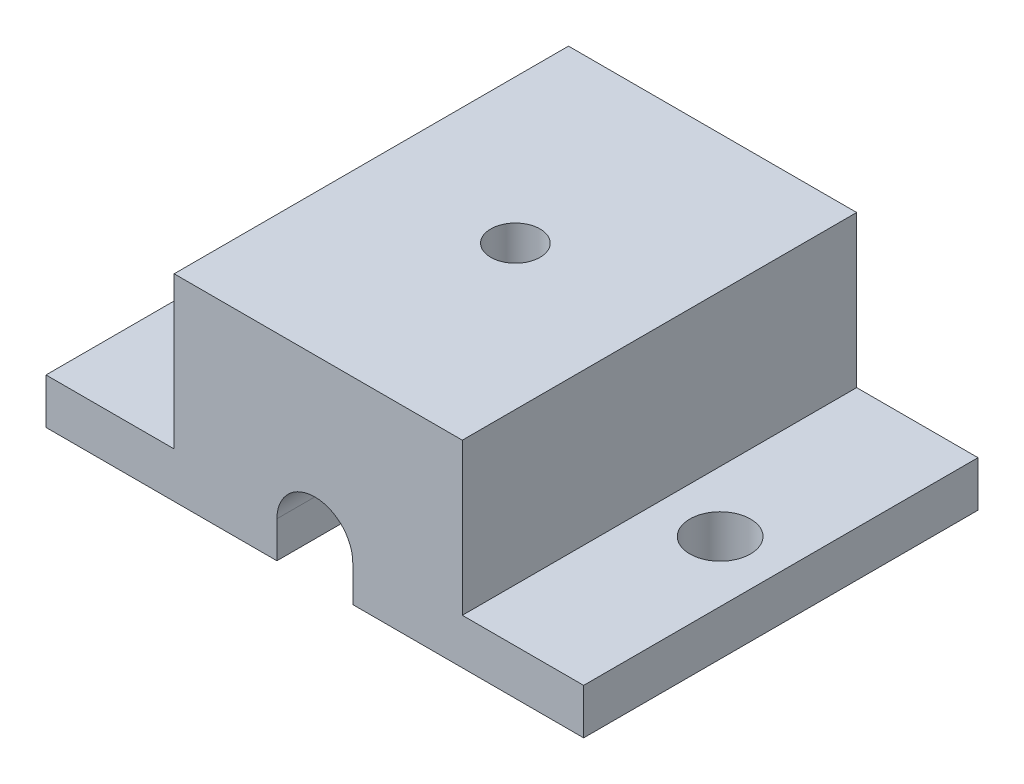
ISO-10303-21;
HEADER;
FILE_DESCRIPTION(('STEP AP214'),'2;1');
FILE_NAME('part.step','',(''),(''),'','','');
FILE_SCHEMA(('AUTOMOTIVE_DESIGN { 1 0 10303 214 1 1 1 1 }'));
ENDSEC;
DATA;
#1=APPLICATION_CONTEXT('core data for automotive mechanical design processes');
#2=APPLICATION_PROTOCOL_DEFINITION('international standard','automotive_design',2000,#1);
#3=PRODUCT_CONTEXT('',#1,'mechanical');
#4=PRODUCT('Part','Part','',(#3));
#5=PRODUCT_RELATED_PRODUCT_CATEGORY('part','',(#4));
#6=PRODUCT_DEFINITION_FORMATION('','',#4);
#7=PRODUCT_DEFINITION_CONTEXT('part definition',#1,'design');
#8=PRODUCT_DEFINITION('design','',#6,#7);
#9=PRODUCT_DEFINITION_SHAPE('','',#8);
#10=(LENGTH_UNIT() NAMED_UNIT(*) SI_UNIT(.MILLI.,.METRE.));
#11=(NAMED_UNIT(*) PLANE_ANGLE_UNIT() SI_UNIT($,.RADIAN.));
#12=(NAMED_UNIT(*) SI_UNIT($,.STERADIAN.) SOLID_ANGLE_UNIT());
#13=UNCERTAINTY_MEASURE_WITH_UNIT(LENGTH_MEASURE(1.E-05),#10,'distance_accuracy_value','');
#14=(GEOMETRIC_REPRESENTATION_CONTEXT(3) GLOBAL_UNCERTAINTY_ASSIGNED_CONTEXT((#13)) GLOBAL_UNIT_ASSIGNED_CONTEXT((#10,
#11,#12)) REPRESENTATION_CONTEXT('',''));
#15=CARTESIAN_POINT('',(0.,0.,0.));
#16=DIRECTION('',(0.,0.,1.));
#17=DIRECTION('',(1.,0.,0.));
#18=AXIS2_PLACEMENT_3D('',#15,#16,#17);
#19=CARTESIAN_POINT('',(35.4483122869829,0.,26.));
#20=DIRECTION('',(0.,1.,0.));
#21=DIRECTION('',(0.,0.,1.));
#22=AXIS2_PLACEMENT_3D('',#19,#20,#21);
#23=PLANE('',#22);
#24=CARTESIAN_POINT('',(4.,0.,13.));
#25=DIRECTION('',(0.,1.,0.));
#26=DIRECTION('',(0.,0.,1.));
#27=AXIS2_PLACEMENT_3D('',#24,#25,#26);
#28=CIRCLE('',#27,2.);
#29=CARTESIAN_POINT('',(4.,0.,15.));
#30=VERTEX_POINT('',#29);
#31=EDGE_CURVE('E208',#30,#30,#28,.T.);
#32=ORIENTED_EDGE('',*,*,#31,.T.);
#33=EDGE_LOOP('',(#32));
#34=FACE_BOUND('',#33,.T.);
#35=DIRECTION('',(1.,0.,0.));
#36=VECTOR('',#35,1.);
#37=CARTESIAN_POINT('',(35.4483122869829,0.,0.));
#38=LINE('',#37,#36);
#39=CARTESIAN_POINT('',(0.,0.,0.));
#40=VERTEX_POINT('',#39);
#41=CARTESIAN_POINT('',(15.225,0.,0.));
#42=VERTEX_POINT('',#41);
#43=EDGE_CURVE('E151',#40,#42,#38,.T.);
#44=ORIENTED_EDGE('',*,*,#43,.T.);
#45=DIRECTION('',(0.,0.,-1.));
#46=VECTOR('',#45,1.);
#47=CARTESIAN_POINT('',(15.225,0.,26.));
#48=LINE('',#47,#46);
#49=CARTESIAN_POINT('',(15.225,0.,26.));
#50=VERTEX_POINT('',#49);
#51=EDGE_CURVE('E224',#50,#42,#48,.T.);
#52=ORIENTED_EDGE('',*,*,#51,.F.);
#53=DIRECTION('',(1.,0.,0.));
#54=VECTOR('',#53,1.);
#55=CARTESIAN_POINT('',(35.4483122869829,0.,26.));
#56=LINE('',#55,#54);
#57=CARTESIAN_POINT('',(0.,0.,26.));
#58=VERTEX_POINT('',#57);
#59=EDGE_CURVE('E203',#58,#50,#56,.T.);
#60=ORIENTED_EDGE('',*,*,#59,.F.);
#61=DIRECTION('',(0.,0.,-1.));
#62=VECTOR('',#61,1.);
#63=CARTESIAN_POINT('',(0.,0.,26.));
#64=LINE('',#63,#62);
#65=EDGE_CURVE('E147',#58,#40,#64,.T.);
#66=ORIENTED_EDGE('',*,*,#65,.T.);
#67=EDGE_LOOP('',(#44,#52,#60,#66));
#68=FACE_BOUND('',#67,.T.);
#69=ADVANCED_FACE('F34',(#34,#68),#23,.F.);
#70=CARTESIAN_POINT('',(31.4483122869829,0.,13.));
#71=DIRECTION('',(0.,1.,0.));
#72=DIRECTION('',(0.,0.,1.));
#73=AXIS2_PLACEMENT_3D('',#70,#71,#72);
#74=CIRCLE('',#73,2.00000000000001);
#75=CARTESIAN_POINT('',(31.4483122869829,0.,15.));
#76=VERTEX_POINT('',#75);
#77=EDGE_CURVE('E205',#76,#76,#74,.T.);
#78=ORIENTED_EDGE('',*,*,#77,.T.);
#79=EDGE_LOOP('',(#78));
#80=FACE_BOUND('',#79,.T.);
#81=CARTESIAN_POINT('',(20.225,0.,26.));
#82=VERTEX_POINT('',#81);
#83=CARTESIAN_POINT('',(35.4483122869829,0.,26.));
#84=VERTEX_POINT('',#83);
#85=EDGE_CURVE('E105',#82,#84,#56,.T.);
#86=ORIENTED_EDGE('',*,*,#85,.F.);
#87=DIRECTION('',(0.,0.,-1.));
#88=VECTOR('',#87,1.);
#89=CARTESIAN_POINT('',(20.225,0.,26.));
#90=LINE('',#89,#88);
#91=CARTESIAN_POINT('',(20.225,0.,0.));
#92=VERTEX_POINT('',#91);
#93=EDGE_CURVE('E220',#82,#92,#90,.T.);
#94=ORIENTED_EDGE('',*,*,#93,.T.);
#95=CARTESIAN_POINT('',(35.4483122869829,0.,0.));
#96=VERTEX_POINT('',#95);
#97=EDGE_CURVE('E155',#92,#96,#38,.T.);
#98=ORIENTED_EDGE('',*,*,#97,.T.);
#99=DIRECTION('',(0.,0.,-1.));
#100=VECTOR('',#99,1.);
#101=CARTESIAN_POINT('',(35.4483122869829,0.,26.));
#102=LINE('',#101,#100);
#103=EDGE_CURVE('E11',#84,#96,#102,.T.);
#104=ORIENTED_EDGE('',*,*,#103,.F.);
#105=EDGE_LOOP('',(#86,#94,#98,#104));
#106=FACE_BOUND('',#105,.T.);
#107=ADVANCED_FACE('F36',(#80,#106),#23,.F.);
#108=CARTESIAN_POINT('',(35.4483122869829,0.,26.));
#109=DIRECTION('',(-1.,0.,0.));
#110=DIRECTION('',(0.,-1.,0.));
#111=AXIS2_PLACEMENT_3D('',#108,#109,#110);
#112=PLANE('',#111);
#113=DIRECTION('',(0.,1.,0.));
#114=VECTOR('',#113,1.);
#115=CARTESIAN_POINT('',(35.4483122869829,0.,0.));
#116=LINE('',#115,#114);
#117=CARTESIAN_POINT('',(35.4483122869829,3.,0.));
#118=VERTEX_POINT('',#117);
#119=EDGE_CURVE('E154',#96,#118,#116,.T.);
#120=ORIENTED_EDGE('',*,*,#119,.T.);
#121=DIRECTION('',(0.,0.,-1.));
#122=VECTOR('',#121,1.);
#123=CARTESIAN_POINT('',(35.4483122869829,3.,26.));
#124=LINE('',#123,#122);
#125=CARTESIAN_POINT('',(35.4483122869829,3.,26.));
#126=VERTEX_POINT('',#125);
#127=EDGE_CURVE('E48',#126,#118,#124,.T.);
#128=ORIENTED_EDGE('',*,*,#127,.F.);
#129=DIRECTION('',(0.,1.,0.));
#130=VECTOR('',#129,1.);
#131=CARTESIAN_POINT('',(35.4483122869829,0.,26.));
#132=LINE('',#131,#130);
#133=EDGE_CURVE('E201',#84,#126,#132,.T.);
#134=ORIENTED_EDGE('',*,*,#133,.F.);
#135=ORIENTED_EDGE('',*,*,#103,.T.);
#136=EDGE_LOOP('',(#120,#128,#134,#135));
#137=FACE_BOUND('',#136,.T.);
#138=ADVANCED_FACE('F266',(#137),#112,.F.);
#139=CARTESIAN_POINT('',(35.4483122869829,3.,26.));
#140=DIRECTION('',(0.,-1.,0.));
#141=DIRECTION('',(1.,0.,0.));
#142=AXIS2_PLACEMENT_3D('',#139,#140,#141);
#143=PLANE('',#142);
#144=CARTESIAN_POINT('',(31.4483122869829,3.,13.));
#145=DIRECTION('',(0.,1.,0.));
#146=DIRECTION('',(0.,0.,1.));
#147=AXIS2_PLACEMENT_3D('',#144,#145,#146);
#148=CIRCLE('',#147,2.00000000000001);
#149=CARTESIAN_POINT('',(31.4483122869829,3.,15.));
#150=VERTEX_POINT('',#149);
#151=EDGE_CURVE('E212',#150,#150,#148,.T.);
#152=ORIENTED_EDGE('',*,*,#151,.F.);
#153=EDGE_LOOP('',(#152));
#154=FACE_BOUND('',#153,.T.);
#155=DIRECTION('',(-1.,0.,0.));
#156=VECTOR('',#155,1.);
#157=CARTESIAN_POINT('',(35.4483122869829,3.,0.));
#158=LINE('',#157,#156);
#159=CARTESIAN_POINT('',(27.4483122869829,3.,0.));
#160=VERTEX_POINT('',#159);
#161=EDGE_CURVE('E157',#118,#160,#158,.T.);
#162=ORIENTED_EDGE('',*,*,#161,.T.);
#163=DIRECTION('',(0.,0.,-1.));
#164=VECTOR('',#163,1.);
#165=CARTESIAN_POINT('',(27.4483122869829,3.,26.));
#166=LINE('',#165,#164);
#167=CARTESIAN_POINT('',(27.4483122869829,3.,26.));
#168=VERTEX_POINT('',#167);
#169=EDGE_CURVE('E173',#168,#160,#166,.T.);
#170=ORIENTED_EDGE('',*,*,#169,.F.);
#171=DIRECTION('',(-1.,0.,0.));
#172=VECTOR('',#171,1.);
#173=CARTESIAN_POINT('',(35.4483122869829,3.,26.));
#174=LINE('',#173,#172);
#175=EDGE_CURVE('E183',#126,#168,#174,.T.);
#176=ORIENTED_EDGE('',*,*,#175,.F.);
#177=ORIENTED_EDGE('',*,*,#127,.T.);
#178=EDGE_LOOP('',(#162,#170,#176,#177));
#179=FACE_BOUND('',#178,.T.);
#180=ADVANCED_FACE('F181',(#154,#179),#143,.F.);
#181=CARTESIAN_POINT('',(27.4483122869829,3.,26.));
#182=DIRECTION('',(-1.,0.,0.));
#183=DIRECTION('',(0.,0.,1.));
#184=AXIS2_PLACEMENT_3D('',#181,#182,#183);
#185=PLANE('',#184);
#186=DIRECTION('',(0.,1.,0.));
#187=VECTOR('',#186,1.);
#188=CARTESIAN_POINT('',(27.4483122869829,3.,0.));
#189=LINE('',#188,#187);
#190=CARTESIAN_POINT('',(27.4483122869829,13.,0.));
#191=VERTEX_POINT('',#190);
#192=EDGE_CURVE('E159',#160,#191,#189,.T.);
#193=ORIENTED_EDGE('',*,*,#192,.T.);
#194=DIRECTION('',(0.,0.,-1.));
#195=VECTOR('',#194,1.);
#196=CARTESIAN_POINT('',(27.4483122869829,13.,26.));
#197=LINE('',#196,#195);
#198=CARTESIAN_POINT('',(27.4483122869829,13.,26.));
#199=VERTEX_POINT('',#198);
#200=EDGE_CURVE('E170',#199,#191,#197,.T.);
#201=ORIENTED_EDGE('',*,*,#200,.F.);
#202=DIRECTION('',(0.,1.,0.));
#203=VECTOR('',#202,1.);
#204=CARTESIAN_POINT('',(27.4483122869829,3.,26.));
#205=LINE('',#204,#203);
#206=EDGE_CURVE('E197',#168,#199,#205,.T.);
#207=ORIENTED_EDGE('',*,*,#206,.F.);
#208=ORIENTED_EDGE('',*,*,#169,.T.);
#209=EDGE_LOOP('',(#193,#201,#207,#208));
#210=FACE_BOUND('',#209,.T.);
#211=ADVANCED_FACE('F193',(#210),#185,.F.);
#212=CARTESIAN_POINT('',(27.4483122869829,13.,26.));
#213=DIRECTION('',(0.,-1.,0.));
#214=DIRECTION('',(0.,0.,-1.));
#215=AXIS2_PLACEMENT_3D('',#212,#213,#214);
#216=PLANE('',#215);
#217=CARTESIAN_POINT('',(17.9483122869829,13.,13.));
#218=DIRECTION('',(0.,1.,0.));
#219=DIRECTION('',(0.,0.,1.));
#220=AXIS2_PLACEMENT_3D('',#217,#218,#219);
#221=CIRCLE('',#220,1.625);
#222=CARTESIAN_POINT('',(17.9483122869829,13.,14.625));
#223=VERTEX_POINT('',#222);
#224=EDGE_CURVE('E241',#223,#223,#221,.T.);
#225=ORIENTED_EDGE('',*,*,#224,.F.);
#226=EDGE_LOOP('',(#225));
#227=FACE_BOUND('',#226,.T.);
#228=DIRECTION('',(-1.,0.,0.));
#229=VECTOR('',#228,1.);
#230=CARTESIAN_POINT('',(27.4483122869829,13.,0.));
#231=LINE('',#230,#229);
#232=CARTESIAN_POINT('',(8.44831228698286,13.,0.));
#233=VERTEX_POINT('',#232);
#234=EDGE_CURVE('E161',#191,#233,#231,.T.);
#235=ORIENTED_EDGE('',*,*,#234,.T.);
#236=DIRECTION('',(0.,0.,-1.));
#237=VECTOR('',#236,1.);
#238=CARTESIAN_POINT('',(8.44831228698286,13.,26.));
#239=LINE('',#238,#237);
#240=CARTESIAN_POINT('',(8.44831228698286,13.,26.));
#241=VERTEX_POINT('',#240);
#242=EDGE_CURVE('E142',#241,#233,#239,.T.);
#243=ORIENTED_EDGE('',*,*,#242,.F.);
#244=DIRECTION('',(-1.,0.,0.));
#245=VECTOR('',#244,1.);
#246=CARTESIAN_POINT('',(27.4483122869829,13.,26.));
#247=LINE('',#246,#245);
#248=EDGE_CURVE('E130',#199,#241,#247,.T.);
#249=ORIENTED_EDGE('',*,*,#248,.F.);
#250=ORIENTED_EDGE('',*,*,#200,.T.);
#251=EDGE_LOOP('',(#235,#243,#249,#250));
#252=FACE_BOUND('',#251,.T.);
#253=ADVANCED_FACE('F196',(#227,#252),#216,.F.);
#254=CARTESIAN_POINT('',(8.44831228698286,13.,26.));
#255=DIRECTION('',(1.,0.,0.));
#256=DIRECTION('',(0.,1.,0.));
#257=AXIS2_PLACEMENT_3D('',#254,#255,#256);
#258=PLANE('',#257);
#259=DIRECTION('',(0.,-1.,0.));
#260=VECTOR('',#259,1.);
#261=CARTESIAN_POINT('',(8.44831228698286,13.,0.));
#262=LINE('',#261,#260);
#263=CARTESIAN_POINT('',(8.44831228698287,3.,0.));
#264=VERTEX_POINT('',#263);
#265=EDGE_CURVE('E139',#233,#264,#262,.T.);
#266=ORIENTED_EDGE('',*,*,#265,.T.);
#267=DIRECTION('',(0.,0.,-1.));
#268=VECTOR('',#267,1.);
#269=CARTESIAN_POINT('',(8.44831228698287,3.,26.));
#270=LINE('',#269,#268);
#271=CARTESIAN_POINT('',(8.44831228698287,3.,26.));
#272=VERTEX_POINT('',#271);
#273=EDGE_CURVE('E136',#272,#264,#270,.T.);
#274=ORIENTED_EDGE('',*,*,#273,.F.);
#275=DIRECTION('',(0.,-1.,0.));
#276=VECTOR('',#275,1.);
#277=CARTESIAN_POINT('',(8.44831228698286,13.,26.));
#278=LINE('',#277,#276);
#279=EDGE_CURVE('E122',#241,#272,#278,.T.);
#280=ORIENTED_EDGE('',*,*,#279,.F.);
#281=ORIENTED_EDGE('',*,*,#242,.T.);
#282=EDGE_LOOP('',(#266,#274,#280,#281));
#283=FACE_BOUND('',#282,.T.);
#284=ADVANCED_FACE('F137',(#283),#258,.F.);
#285=CARTESIAN_POINT('',(8.44831228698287,3.,26.));
#286=DIRECTION('',(0.,-1.,0.));
#287=DIRECTION('',(1.,0.,0.));
#288=AXIS2_PLACEMENT_3D('',#285,#286,#287);
#289=PLANE('',#288);
#290=CARTESIAN_POINT('',(4.,3.,13.));
#291=DIRECTION('',(0.,1.,0.));
#292=DIRECTION('',(0.,0.,1.));
#293=AXIS2_PLACEMENT_3D('',#290,#291,#292);
#294=CIRCLE('',#293,2.);
#295=CARTESIAN_POINT('',(4.,3.,15.));
#296=VERTEX_POINT('',#295);
#297=EDGE_CURVE('E211',#296,#296,#294,.T.);
#298=ORIENTED_EDGE('',*,*,#297,.F.);
#299=EDGE_LOOP('',(#298));
#300=FACE_BOUND('',#299,.T.);
#301=DIRECTION('',(-1.,0.,0.));
#302=VECTOR('',#301,1.);
#303=CARTESIAN_POINT('',(8.44831228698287,3.,0.));
#304=LINE('',#303,#302);
#305=CARTESIAN_POINT('',(0.,3.,0.));
#306=VERTEX_POINT('',#305);
#307=EDGE_CURVE('E164',#264,#306,#304,.T.);
#308=ORIENTED_EDGE('',*,*,#307,.T.);
#309=DIRECTION('',(0.,0.,-1.));
#310=VECTOR('',#309,1.);
#311=CARTESIAN_POINT('',(0.,3.,26.));
#312=LINE('',#311,#310);
#313=CARTESIAN_POINT('',(0.,3.,26.));
#314=VERTEX_POINT('',#313);
#315=EDGE_CURVE('E143',#314,#306,#312,.T.);
#316=ORIENTED_EDGE('',*,*,#315,.F.);
#317=DIRECTION('',(-1.,0.,0.));
#318=VECTOR('',#317,1.);
#319=CARTESIAN_POINT('',(8.44831228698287,3.,26.));
#320=LINE('',#319,#318);
#321=EDGE_CURVE('E127',#272,#314,#320,.T.);
#322=ORIENTED_EDGE('',*,*,#321,.F.);
#323=ORIENTED_EDGE('',*,*,#273,.T.);
#324=EDGE_LOOP('',(#308,#316,#322,#323));
#325=FACE_BOUND('',#324,.T.);
#326=ADVANCED_FACE('F145',(#300,#325),#289,.F.);
#327=CARTESIAN_POINT('',(0.,3.,26.));
#328=DIRECTION('',(1.,0.,0.));
#329=DIRECTION('',(0.,1.,0.));
#330=AXIS2_PLACEMENT_3D('',#327,#328,#329);
#331=PLANE('',#330);
#332=DIRECTION('',(0.,-1.,0.));
#333=VECTOR('',#332,1.);
#334=CARTESIAN_POINT('',(0.,3.,0.));
#335=LINE('',#334,#333);
#336=EDGE_CURVE('E97',#306,#40,#335,.T.);
#337=ORIENTED_EDGE('',*,*,#336,.T.);
#338=ORIENTED_EDGE('',*,*,#65,.F.);
#339=DIRECTION('',(0.,-1.,0.));
#340=VECTOR('',#339,1.);
#341=CARTESIAN_POINT('',(0.,3.,26.));
#342=LINE('',#341,#340);
#343=EDGE_CURVE('E64',#314,#58,#342,.T.);
#344=ORIENTED_EDGE('',*,*,#343,.F.);
#345=ORIENTED_EDGE('',*,*,#315,.T.);
#346=EDGE_LOOP('',(#337,#338,#344,#345));
#347=FACE_BOUND('',#346,.T.);
#348=ADVANCED_FACE('F309',(#347),#331,.F.);
#349=CARTESIAN_POINT('',(0.,0.,26.));
#350=DIRECTION('',(0.,0.,1.));
#351=DIRECTION('',(1.,0.,0.));
#352=AXIS2_PLACEMENT_3D('',#349,#350,#351);
#353=PLANE('',#352);
#354=DIRECTION('',(0.,1.,0.));
#355=VECTOR('',#354,1.);
#356=CARTESIAN_POINT('',(15.225,2.4,26.));
#357=LINE('',#356,#355);
#358=CARTESIAN_POINT('',(15.225,2.4,26.));
#359=VERTEX_POINT('',#358);
#360=EDGE_CURVE('E221',#50,#359,#357,.T.);
#361=ORIENTED_EDGE('',*,*,#360,.T.);
#362=CARTESIAN_POINT('',(17.725,2.4,26.));
#363=DIRECTION('',(0.,0.,-1.));
#364=DIRECTION('',(-1.,0.,0.));
#365=AXIS2_PLACEMENT_3D('',#362,#363,#364);
#366=CIRCLE('',#365,2.5);
#367=CARTESIAN_POINT('',(20.225,2.4,26.));
#368=VERTEX_POINT('',#367);
#369=EDGE_CURVE('E231',#359,#368,#366,.T.);
#370=ORIENTED_EDGE('',*,*,#369,.T.);
#371=DIRECTION('',(0.,-1.,0.));
#372=VECTOR('',#371,1.);
#373=CARTESIAN_POINT('',(20.225,2.4,26.));
#374=LINE('',#373,#372);
#375=EDGE_CURVE('E237',#368,#82,#374,.T.);
#376=ORIENTED_EDGE('',*,*,#375,.T.);
#377=ORIENTED_EDGE('',*,*,#85,.T.);
#378=ORIENTED_EDGE('',*,*,#133,.T.);
#379=ORIENTED_EDGE('',*,*,#175,.T.);
#380=ORIENTED_EDGE('',*,*,#206,.T.);
#381=ORIENTED_EDGE('',*,*,#248,.T.);
#382=ORIENTED_EDGE('',*,*,#279,.T.);
#383=ORIENTED_EDGE('',*,*,#321,.T.);
#384=ORIENTED_EDGE('',*,*,#343,.T.);
#385=ORIENTED_EDGE('',*,*,#59,.T.);
#386=EDGE_LOOP('',(#361,#370,#376,#377,#378,#379,#380,#381,#382,#383,#384,#385));
#387=FACE_BOUND('',#386,.T.);
#388=ADVANCED_FACE('F125',(#387),#353,.T.);
#389=CARTESIAN_POINT('',(0.,0.,0.));
#390=DIRECTION('',(0.,0.,1.));
#391=DIRECTION('',(1.,0.,0.));
#392=AXIS2_PLACEMENT_3D('',#389,#390,#391);
#393=PLANE('',#392);
#394=CARTESIAN_POINT('',(17.725,2.4,0.));
#395=DIRECTION('',(0.,0.,-1.));
#396=DIRECTION('',(-1.,0.,0.));
#397=AXIS2_PLACEMENT_3D('',#394,#395,#396);
#398=CIRCLE('',#397,2.5);
#399=CARTESIAN_POINT('',(15.225,2.4,0.));
#400=VERTEX_POINT('',#399);
#401=CARTESIAN_POINT('',(20.225,2.4,0.));
#402=VERTEX_POINT('',#401);
#403=EDGE_CURVE('E55',#400,#402,#398,.T.);
#404=ORIENTED_EDGE('',*,*,#403,.F.);
#405=DIRECTION('',(0.,1.,0.));
#406=VECTOR('',#405,1.);
#407=CARTESIAN_POINT('',(15.225,2.4,0.));
#408=LINE('',#407,#406);
#409=EDGE_CURVE('E228',#42,#400,#408,.T.);
#410=ORIENTED_EDGE('',*,*,#409,.F.);
#411=ORIENTED_EDGE('',*,*,#43,.F.);
#412=ORIENTED_EDGE('',*,*,#336,.F.);
#413=ORIENTED_EDGE('',*,*,#307,.F.);
#414=ORIENTED_EDGE('',*,*,#265,.F.);
#415=ORIENTED_EDGE('',*,*,#234,.F.);
#416=ORIENTED_EDGE('',*,*,#192,.F.);
#417=ORIENTED_EDGE('',*,*,#161,.F.);
#418=ORIENTED_EDGE('',*,*,#119,.F.);
#419=ORIENTED_EDGE('',*,*,#97,.F.);
#420=DIRECTION('',(0.,-1.,0.));
#421=VECTOR('',#420,1.);
#422=CARTESIAN_POINT('',(20.225,2.4,0.));
#423=LINE('',#422,#421);
#424=EDGE_CURVE('E232',#402,#92,#423,.T.);
#425=ORIENTED_EDGE('',*,*,#424,.F.);
#426=EDGE_LOOP('',(#404,#410,#411,#412,#413,#414,#415,#416,#417,#418,#419,#425));
#427=FACE_BOUND('',#426,.T.);
#428=ADVANCED_FACE('F188',(#427),#393,.F.);
#429=CARTESIAN_POINT('',(4.,-17.,13.));
#430=DIRECTION('',(0.,1.,0.));
#431=DIRECTION('',(0.,0.,1.));
#432=AXIS2_PLACEMENT_3D('',#429,#430,#431);
#433=CYLINDRICAL_SURFACE('',#432,2.);
#434=ORIENTED_EDGE('',*,*,#297,.T.);
#435=EDGE_LOOP('',(#434));
#436=FACE_BOUND('',#435,.T.);
#437=ORIENTED_EDGE('',*,*,#31,.F.);
#438=EDGE_LOOP('',(#437));
#439=FACE_BOUND('',#438,.T.);
#440=ADVANCED_FACE('F315',(#436,#439),#433,.F.);
#441=CARTESIAN_POINT('',(31.4483122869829,-17.,13.));
#442=DIRECTION('',(0.,1.,0.));
#443=DIRECTION('',(0.,0.,1.));
#444=AXIS2_PLACEMENT_3D('',#441,#442,#443);
#445=CYLINDRICAL_SURFACE('',#444,2.00000000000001);
#446=ORIENTED_EDGE('',*,*,#151,.T.);
#447=EDGE_LOOP('',(#446));
#448=FACE_BOUND('',#447,.T.);
#449=ORIENTED_EDGE('',*,*,#77,.F.);
#450=EDGE_LOOP('',(#449));
#451=FACE_BOUND('',#450,.T.);
#452=ADVANCED_FACE('F318',(#448,#451),#445,.F.);
#453=CARTESIAN_POINT('',(17.725,2.4,26.));
#454=DIRECTION('',(0.,0.,-1.));
#455=DIRECTION('',(-1.,0.,0.));
#456=AXIS2_PLACEMENT_3D('',#453,#454,#455);
#457=CYLINDRICAL_SURFACE('',#456,2.5);
#458=CARTESIAN_POINT('',(17.9483122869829,4.89000634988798,14.625));
#459=CARTESIAN_POINT('',(18.0324630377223,4.88245195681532,14.6249919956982));
#460=CARTESIAN_POINT('',(18.1163573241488,4.87058699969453,14.6184139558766));
#461=CARTESIAN_POINT('',(18.2808107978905,4.83888067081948,14.5928095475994));
#462=CARTESIAN_POINT('',(18.3613588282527,4.81901466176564,14.5737446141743));
#463=CARTESIAN_POINT('',(18.5163773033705,4.77280856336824,14.5246292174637));
#464=CARTESIAN_POINT('',(18.5908844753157,4.74651223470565,14.494652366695));
#465=CARTESIAN_POINT('',(18.73310019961,4.68902240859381,14.425132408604));
#466=CARTESIAN_POINT('',(18.8008128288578,4.65783187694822,14.3855950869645));
#467=CARTESIAN_POINT('',(18.9359324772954,4.58861145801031,14.2933095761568));
#468=CARTESIAN_POINT('',(19.0024767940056,4.55020667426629,14.239583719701));
#469=CARTESIAN_POINT('',(19.1260571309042,4.47181370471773,14.1228473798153));
#470=CARTESIAN_POINT('',(19.183070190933,4.43182197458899,14.0598151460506));
#471=CARTESIAN_POINT('',(19.2957167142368,4.3464394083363,13.9137984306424));
#472=CARTESIAN_POINT('',(19.3495008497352,4.30127354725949,13.8292415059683));
#473=CARTESIAN_POINT('',(19.4415968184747,4.21854720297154,13.6487726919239));
#474=CARTESIAN_POINT('',(19.4799631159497,4.18096018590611,13.5529023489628));
#475=CARTESIAN_POINT('',(19.5267396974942,4.13331390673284,13.3913794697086));
#476=CARTESIAN_POINT('',(19.5409948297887,4.11825361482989,13.3289072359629));
#477=CARTESIAN_POINT('',(19.5620664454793,4.09570937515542,13.2014358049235));
#478=CARTESIAN_POINT('',(19.5688976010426,4.08821048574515,13.1364418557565));
#479=CARTESIAN_POINT('',(19.5746311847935,4.08192974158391,13.0053787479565));
#480=CARTESIAN_POINT('',(19.5734991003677,4.08318583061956,12.9393061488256));
#481=CARTESIAN_POINT('',(19.5633243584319,4.09428848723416,12.8084812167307));
#482=CARTESIAN_POINT('',(19.5542724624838,4.10414508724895,12.7437305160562));
#483=CARTESIAN_POINT('',(19.5262416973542,4.13378726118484,12.6039408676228));
#484=CARTESIAN_POINT('',(19.5055756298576,4.15522487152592,12.5296016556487));
#485=CARTESIAN_POINT('',(19.4550143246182,4.20507822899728,12.3866011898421));
#486=CARTESIAN_POINT('',(19.4250974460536,4.23351030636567,12.3179537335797));
#487=CARTESIAN_POINT('',(19.3453757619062,4.30476424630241,12.1641047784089));
#488=CARTESIAN_POINT('',(19.2922702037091,4.34916838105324,12.0813515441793));
#489=CARTESIAN_POINT('',(19.1726880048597,4.4395691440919,11.9271258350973));
#490=CARTESIAN_POINT('',(19.1061980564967,4.48556731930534,11.8556647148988));
#491=CARTESIAN_POINT('',(18.9597161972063,4.57553508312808,11.724276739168));
#492=CARTESIAN_POINT('',(18.8795792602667,4.61947563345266,11.6644903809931));
#493=CARTESIAN_POINT('',(18.7073436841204,4.70087396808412,11.5596509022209));
#494=CARTESIAN_POINT('',(18.6152720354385,4.73834594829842,11.5145653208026));
#495=CARTESIAN_POINT('',(18.445441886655,4.79517726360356,11.4509559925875));
#496=CARTESIAN_POINT('',(18.3698414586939,4.81672310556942,11.4286119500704));
#497=CARTESIAN_POINT('',(18.2146126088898,4.85287790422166,11.3950079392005));
#498=CARTESIAN_POINT('',(18.1349870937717,4.86749178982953,11.3837400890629));
#499=CARTESIAN_POINT('',(17.9735964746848,4.8889452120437,11.373179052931));
#500=CARTESIAN_POINT('',(17.8918247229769,4.89575668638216,11.3739289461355));
#501=CARTESIAN_POINT('',(17.7290546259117,4.90132248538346,11.387789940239));
#502=CARTESIAN_POINT('',(17.6480563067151,4.90007653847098,11.4009014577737));
#503=CARTESIAN_POINT('',(17.4939284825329,4.8904290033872,11.4379216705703));
#504=CARTESIAN_POINT('',(17.4206131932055,4.88243701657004,11.4611762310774));
#505=CARTESIAN_POINT('',(17.2787065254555,4.86088970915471,11.5174067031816));
#506=CARTESIAN_POINT('',(17.2101160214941,4.84733336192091,11.550384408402));
#507=CARTESIAN_POINT('',(17.0743449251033,4.81492343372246,11.6276558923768));
#508=CARTESIAN_POINT('',(17.0075969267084,4.79576615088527,11.6725788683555));
#509=CARTESIAN_POINT('',(16.8819648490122,4.75450042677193,11.7712132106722));
#510=CARTESIAN_POINT('',(16.8230859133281,4.73239007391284,11.8249302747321));
#511=CARTESIAN_POINT('',(16.7064476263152,4.68408838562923,11.9480765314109));
#512=CARTESIAN_POINT('',(16.6499514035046,4.65775347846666,12.0186503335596));
#513=CARTESIAN_POINT('',(16.5491174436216,4.60691996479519,12.1687015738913));
#514=CARTESIAN_POINT('',(16.5047892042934,4.58242280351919,12.2481858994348));
#515=CARTESIAN_POINT('',(16.4280906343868,4.53777509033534,12.4181237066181));
#516=CARTESIAN_POINT('',(16.3962786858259,4.51784131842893,12.5088914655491));
#517=CARTESIAN_POINT('',(16.3490959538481,4.4875125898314,12.6960462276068));
#518=CARTESIAN_POINT('',(16.3336865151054,4.47709521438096,12.7924194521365));
#519=CARTESIAN_POINT('',(16.3214429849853,4.46883104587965,12.9721610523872));
#520=CARTESIAN_POINT('',(16.3221513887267,4.46932092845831,13.0552911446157));
#521=CARTESIAN_POINT('',(16.3361539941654,4.47874382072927,13.2200065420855));
#522=CARTESIAN_POINT('',(16.34945221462,4.48767952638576,13.3015913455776));
#523=CARTESIAN_POINT('',(16.3864780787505,4.51158594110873,13.4550747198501));
#524=CARTESIAN_POINT('',(16.4093957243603,4.52608165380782,13.5272493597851));
#525=CARTESIAN_POINT('',(16.4645620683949,4.55924290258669,13.666897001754));
#526=CARTESIAN_POINT('',(16.496813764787,4.57790977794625,13.7343684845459));
#527=CARTESIAN_POINT('',(16.5752130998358,4.62041706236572,13.8731965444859));
#528=CARTESIAN_POINT('',(16.6227006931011,4.6446149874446,13.9436869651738));
#529=CARTESIAN_POINT('',(16.7280055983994,4.6933323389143,14.0764120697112));
#530=CARTESIAN_POINT('',(16.7858311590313,4.71785200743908,14.1386400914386));
#531=CARTESIAN_POINT('',(16.9182978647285,4.76744337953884,14.2604345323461));
#532=CARTESIAN_POINT('',(16.9941129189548,4.79224704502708,14.318847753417));
#533=CARTESIAN_POINT('',(17.15610504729,4.83585472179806,14.4220579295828));
#534=CARTESIAN_POINT('',(17.2422800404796,4.85465993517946,14.4668576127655));
#535=CARTESIAN_POINT('',(17.415793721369,4.88223244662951,14.5378972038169));
#536=CARTESIAN_POINT('',(17.5025456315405,4.89165430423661,14.56528937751));
#537=CARTESIAN_POINT('',(17.6353139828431,4.89878682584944,14.5952192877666));
#538=CARTESIAN_POINT('',(17.6799642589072,4.89999989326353,14.60333364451));
#539=CARTESIAN_POINT('',(17.769778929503,4.90000010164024,14.615796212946));
#540=CARTESIAN_POINT('',(17.8149429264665,4.89878900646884,14.6201471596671));
#541=CARTESIAN_POINT('',(17.8895251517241,4.8947556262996,14.6242048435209));
#542=CARTESIAN_POINT('',(17.9189343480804,4.89264367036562,14.6250027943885));
#543=CARTESIAN_POINT('',(17.9483122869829,4.89000634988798,14.625));
#544=B_SPLINE_CURVE_WITH_KNOTS('',3,(#458,#459,#460,#461,#462,#463,#464,#465,#466,#467,#468,
#469,#470,#471,#472,#473,#474,#475,#476,#477,#478,#479,#480,#481,#482,#483,#484,#485,#486,#487,
#488,#489,#490,#491,#492,#493,#494,#495,#496,#497,#498,#499,#500,#501,#502,#503,#504,#505,#506,
#507,#508,#509,#510,#511,#512,#513,#514,#515,#516,#517,#518,#519,#520,#521,#522,#523,#524,#525,
#526,#527,#528,#529,#530,#531,#532,#533,#534,#535,#536,#537,#538,#539,#540,#541,#542,#543),
.UNSPECIFIED.,.T.,.F.,(4,2,2,2,2,2,2,2,2,2,2,2,2,2,2,2,2,2,2,2,2,2,2,2,2,2,2,2,2,2,2,2,2,2,2,2,
2,2,2,2,2,2,4),(0.,0.253357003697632,0.507500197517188,0.759959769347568,1.01226694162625,
1.29248946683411,1.57337759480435,1.90156995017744,2.22859253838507,2.42531310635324,
2.62164418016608,2.81882667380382,3.01623948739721,3.25516453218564,3.49465278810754,
3.81667617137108,4.13902132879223,4.46503435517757,4.79032255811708,5.03447481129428,
5.27845320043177,5.52330635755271,5.76816776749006,5.99914986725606,6.23017460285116,
6.47732500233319,6.72463616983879,7.005895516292,7.28737378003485,7.58027684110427,
7.87248808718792,8.12049191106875,8.36857492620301,8.59899425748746,8.82948767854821,
9.09356248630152,9.35784894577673,9.65290239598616,9.94789667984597,10.2204591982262,
10.3564689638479,10.4923798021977,10.5808294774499),.UNSPECIFIED.);
#545=CARTESIAN_POINT('',(17.9483122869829,4.89000634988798,14.625));
#546=VERTEX_POINT('',#545);
#547=EDGE_CURVE('E38',#546,#546,#544,.T.);
#548=ORIENTED_EDGE('',*,*,#547,.T.);
#549=EDGE_LOOP('',(#548));
#550=FACE_BOUND('',#549,.T.);
#551=ORIENTED_EDGE('',*,*,#403,.T.);
#552=DIRECTION('',(0.,0.,-1.));
#553=VECTOR('',#552,1.);
#554=CARTESIAN_POINT('',(20.225,2.4,26.));
#555=LINE('',#554,#553);
#556=EDGE_CURVE('E218',#368,#402,#555,.T.);
#557=ORIENTED_EDGE('',*,*,#556,.F.);
#558=ORIENTED_EDGE('',*,*,#369,.F.);
#559=DIRECTION('',(0.,0.,-1.));
#560=VECTOR('',#559,1.);
#561=CARTESIAN_POINT('',(15.225,2.4,26.));
#562=LINE('',#561,#560);
#563=EDGE_CURVE('E215',#359,#400,#562,.T.);
#564=ORIENTED_EDGE('',*,*,#563,.T.);
#565=EDGE_LOOP('',(#551,#557,#558,#564));
#566=FACE_BOUND('',#565,.T.);
#567=ADVANCED_FACE('F248',(#550,#566),#457,.F.);
#568=CARTESIAN_POINT('',(15.225,2.4,26.));
#569=DIRECTION('',(-1.,0.,0.));
#570=DIRECTION('',(0.,0.,1.));
#571=AXIS2_PLACEMENT_3D('',#568,#569,#570);
#572=PLANE('',#571);
#573=ORIENTED_EDGE('',*,*,#409,.T.);
#574=ORIENTED_EDGE('',*,*,#563,.F.);
#575=ORIENTED_EDGE('',*,*,#360,.F.);
#576=ORIENTED_EDGE('',*,*,#51,.T.);
#577=EDGE_LOOP('',(#573,#574,#575,#576));
#578=FACE_BOUND('',#577,.T.);
#579=ADVANCED_FACE('F256',(#578),#572,.F.);
#580=CARTESIAN_POINT('',(20.225,2.4,26.));
#581=DIRECTION('',(1.,0.,0.));
#582=DIRECTION('',(0.,0.,-1.));
#583=AXIS2_PLACEMENT_3D('',#580,#581,#582);
#584=PLANE('',#583);
#585=ORIENTED_EDGE('',*,*,#424,.T.);
#586=ORIENTED_EDGE('',*,*,#93,.F.);
#587=ORIENTED_EDGE('',*,*,#375,.F.);
#588=ORIENTED_EDGE('',*,*,#556,.T.);
#589=EDGE_LOOP('',(#585,#586,#587,#588));
#590=FACE_BOUND('',#589,.T.);
#591=ADVANCED_FACE('F252',(#590),#584,.F.);
#592=CARTESIAN_POINT('',(17.9483122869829,0.,13.));
#593=DIRECTION('',(0.,1.,0.));
#594=DIRECTION('',(0.,0.,1.));
#595=AXIS2_PLACEMENT_3D('',#592,#593,#594);
#596=CYLINDRICAL_SURFACE('',#595,1.625);
#597=ORIENTED_EDGE('',*,*,#224,.T.);
#598=EDGE_LOOP('',(#597));
#599=FACE_BOUND('',#598,.T.);
#600=ORIENTED_EDGE('',*,*,#547,.F.);
#601=EDGE_LOOP('',(#600));
#602=FACE_BOUND('',#601,.T.);
#603=ADVANCED_FACE('F250',(#599,#602),#596,.F.);
#604=CLOSED_SHELL('',(#69,#107,#138,#180,#211,#253,#284,#326,#348,#388,#428,#440,#452,#567,#579,
#591,#603));
#605=MANIFOLD_SOLID_BREP('B2',#604);
#606=ADVANCED_BREP_SHAPE_REPRESENTATION('',(#18,#605),#14);
#607=SHAPE_DEFINITION_REPRESENTATION(#9,#606);
ENDSEC;
END-ISO-10303-21;
